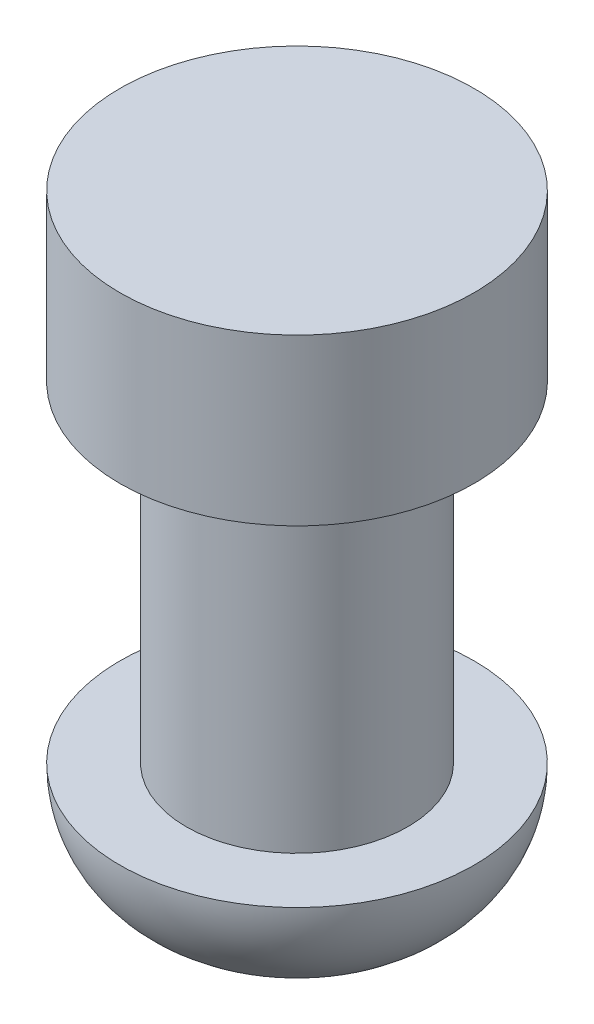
ISO-10303-21;
HEADER;
FILE_DESCRIPTION(('STEP AP214'),'2;1');
FILE_NAME('part.step','',(''),(''),'','','');
FILE_SCHEMA(('AUTOMOTIVE_DESIGN { 1 0 10303 214 1 1 1 1 }'));
ENDSEC;
DATA;
#1=APPLICATION_CONTEXT('core data for automotive mechanical design processes');
#2=APPLICATION_PROTOCOL_DEFINITION('international standard','automotive_design',2000,#1);
#3=PRODUCT_CONTEXT('',#1,'mechanical');
#4=PRODUCT('Part','Part','',(#3));
#5=PRODUCT_RELATED_PRODUCT_CATEGORY('part','',(#4));
#6=PRODUCT_DEFINITION_FORMATION('','',#4);
#7=PRODUCT_DEFINITION_CONTEXT('part definition',#1,'design');
#8=PRODUCT_DEFINITION('design','',#6,#7);
#9=PRODUCT_DEFINITION_SHAPE('','',#8);
#10=(LENGTH_UNIT() NAMED_UNIT(*) SI_UNIT(.MILLI.,.METRE.));
#11=(NAMED_UNIT(*) PLANE_ANGLE_UNIT() SI_UNIT($,.RADIAN.));
#12=(NAMED_UNIT(*) SI_UNIT($,.STERADIAN.) SOLID_ANGLE_UNIT());
#13=UNCERTAINTY_MEASURE_WITH_UNIT(LENGTH_MEASURE(1.E-05),#10,'distance_accuracy_value','');
#14=(GEOMETRIC_REPRESENTATION_CONTEXT(3) GLOBAL_UNCERTAINTY_ASSIGNED_CONTEXT((#13)) GLOBAL_UNIT_ASSIGNED_CONTEXT((#10,
#11,#12)) REPRESENTATION_CONTEXT('',''));
#15=CARTESIAN_POINT('',(0.,0.,0.));
#16=DIRECTION('',(0.,0.,1.));
#17=DIRECTION('',(1.,0.,0.));
#18=AXIS2_PLACEMENT_3D('',#15,#16,#17);
#19=CARTESIAN_POINT('',(0.,3.556,0.));
#20=DIRECTION('',(0.,-1.,0.));
#21=DIRECTION('',(0.,0.,-1.));
#22=AXIS2_PLACEMENT_3D('',#19,#20,#21);
#23=CYLINDRICAL_SURFACE('',#22,1.190625);
#24=CARTESIAN_POINT('',(0.,3.556,0.));
#25=DIRECTION('',(0.,1.,0.));
#26=DIRECTION('',(0.,0.,1.));
#27=AXIS2_PLACEMENT_3D('',#24,#25,#26);
#28=CIRCLE('',#27,1.190625);
#29=CARTESIAN_POINT('',(0.,3.556,1.190625));
#30=VERTEX_POINT('',#29);
#31=EDGE_CURVE('E51',#30,#30,#28,.T.);
#32=ORIENTED_EDGE('',*,*,#31,.F.);
#33=EDGE_LOOP('',(#32));
#34=FACE_BOUND('',#33,.T.);
#35=CARTESIAN_POINT('',(0.,0.,0.));
#36=DIRECTION('',(0.,1.,0.));
#37=DIRECTION('',(0.,0.,1.));
#38=AXIS2_PLACEMENT_3D('',#35,#36,#37);
#39=CIRCLE('',#38,1.190625);
#40=CARTESIAN_POINT('',(0.,0.,1.190625));
#41=VERTEX_POINT('',#40);
#42=EDGE_CURVE('E65',#41,#41,#39,.T.);
#43=ORIENTED_EDGE('',*,*,#42,.T.);
#44=EDGE_LOOP('',(#43));
#45=FACE_BOUND('',#44,.T.);
#46=ADVANCED_FACE('F43',(#34,#45),#23,.T.);
#47=CARTESIAN_POINT('',(0.,5.334,0.));
#48=DIRECTION('',(0.,-1.,0.));
#49=DIRECTION('',(0.,0.,-1.));
#50=AXIS2_PLACEMENT_3D('',#47,#48,#49);
#51=CYLINDRICAL_SURFACE('',#50,1.905);
#52=CARTESIAN_POINT('',(0.,5.334,0.));
#53=DIRECTION('',(0.,1.,0.));
#54=DIRECTION('',(0.,0.,1.));
#55=AXIS2_PLACEMENT_3D('',#52,#53,#54);
#56=CIRCLE('',#55,1.905);
#57=CARTESIAN_POINT('',(0.,5.334,1.905));
#58=VERTEX_POINT('',#57);
#59=EDGE_CURVE('E56',#58,#58,#56,.T.);
#60=ORIENTED_EDGE('',*,*,#59,.F.);
#61=EDGE_LOOP('',(#60));
#62=FACE_BOUND('',#61,.T.);
#63=CARTESIAN_POINT('',(0.,3.556,0.));
#64=DIRECTION('',(0.,1.,0.));
#65=DIRECTION('',(0.,0.,1.));
#66=AXIS2_PLACEMENT_3D('',#63,#64,#65);
#67=CIRCLE('',#66,1.905);
#68=CARTESIAN_POINT('',(0.,3.556,1.905));
#69=VERTEX_POINT('',#68);
#70=EDGE_CURVE('E62',#69,#69,#67,.T.);
#71=ORIENTED_EDGE('',*,*,#70,.T.);
#72=EDGE_LOOP('',(#71));
#73=FACE_BOUND('',#72,.T.);
#74=ADVANCED_FACE('F94',(#62,#73),#51,.T.);
#75=CARTESIAN_POINT('',(0.,5.334,0.));
#76=DIRECTION('',(0.,1.,0.));
#77=DIRECTION('',(0.,0.,1.));
#78=AXIS2_PLACEMENT_3D('',#75,#76,#77);
#79=PLANE('',#78);
#80=ORIENTED_EDGE('',*,*,#59,.T.);
#81=EDGE_LOOP('',(#80));
#82=FACE_BOUND('',#81,.T.);
#83=ADVANCED_FACE('F99',(#82),#79,.T.);
#84=CARTESIAN_POINT('',(0.,3.556,0.));
#85=DIRECTION('',(0.,1.,0.));
#86=DIRECTION('',(0.,0.,1.));
#87=AXIS2_PLACEMENT_3D('',#84,#85,#86);
#88=PLANE('',#87);
#89=ORIENTED_EDGE('',*,*,#31,.T.);
#90=EDGE_LOOP('',(#89));
#91=FACE_BOUND('',#90,.T.);
#92=ORIENTED_EDGE('',*,*,#70,.F.);
#93=EDGE_LOOP('',(#92));
#94=FACE_BOUND('',#93,.T.);
#95=ADVANCED_FACE('F90',(#91,#94),#88,.F.);
#96=CARTESIAN_POINT('',(0.,-1.27,0.));
#97=DIRECTION('',(0.,-1.,0.));
#98=DIRECTION('',(0.,0.,-1.));
#99=AXIS2_PLACEMENT_3D('',#96,#97,#98);
#100=PLANE('',#99);
#101=CARTESIAN_POINT('',(0.,-1.27,0.));
#102=DIRECTION('',(0.,-1.,0.));
#103=DIRECTION('',(0.,0.,-1.));
#104=AXIS2_PLACEMENT_3D('',#101,#102,#103);
#105=CIRCLE('',#104,0.635);
#106=CARTESIAN_POINT('',(0.,-1.27,-0.635));
#107=VERTEX_POINT('',#106);
#108=EDGE_CURVE('E10',#107,#107,#105,.T.);
#109=ORIENTED_EDGE('',*,*,#108,.T.);
#110=EDGE_LOOP('',(#109));
#111=FACE_BOUND('',#110,.T.);
#112=ADVANCED_FACE('F82',(#111),#100,.T.);
#113=CARTESIAN_POINT('',(0.,0.,0.));
#114=DIRECTION('',(0.,-1.,0.));
#115=DIRECTION('',(0.,0.,-1.));
#116=AXIS2_PLACEMENT_3D('',#113,#114,#115);
#117=PLANE('',#116);
#118=ORIENTED_EDGE('',*,*,#42,.F.);
#119=EDGE_LOOP('',(#118));
#120=FACE_BOUND('',#119,.T.);
#121=CARTESIAN_POINT('',(0.,0.,0.));
#122=DIRECTION('',(0.,-1.,0.));
#123=DIRECTION('',(0.,0.,-1.));
#124=AXIS2_PLACEMENT_3D('',#121,#122,#123);
#125=CIRCLE('',#124,1.905);
#126=CARTESIAN_POINT('',(0.,0.,-1.905));
#127=VERTEX_POINT('',#126);
#128=EDGE_CURVE('E68',#127,#127,#125,.T.);
#129=ORIENTED_EDGE('',*,*,#128,.F.);
#130=EDGE_LOOP('',(#129));
#131=FACE_BOUND('',#130,.T.);
#132=ADVANCED_FACE('F80',(#120,#131),#117,.F.);
#133=CARTESIAN_POINT('',(0.,0.,0.));
#134=DIRECTION('',(0.,-1.,0.));
#135=DIRECTION('',(0.,0.,-1.));
#136=AXIS2_PLACEMENT_3D('',#133,#134,#135);
#137=DEGENERATE_TOROIDAL_SURFACE('',#136,0.635,1.27,.T.);
#138=ORIENTED_EDGE('',*,*,#128,.T.);
#139=EDGE_LOOP('',(#138));
#140=FACE_BOUND('',#139,.T.);
#141=ORIENTED_EDGE('',*,*,#108,.F.);
#142=EDGE_LOOP('',(#141));
#143=FACE_BOUND('',#142,.T.);
#144=ADVANCED_FACE('F45',(#140,#143),#137,.T.);
#145=CLOSED_SHELL('',(#46,#74,#83,#95,#112,#132,#144));
#146=MANIFOLD_SOLID_BREP('B2',#145);
#147=ADVANCED_BREP_SHAPE_REPRESENTATION('',(#18,#146),#14);
#148=SHAPE_DEFINITION_REPRESENTATION(#9,#147);
ENDSEC;
END-ISO-10303-21;
